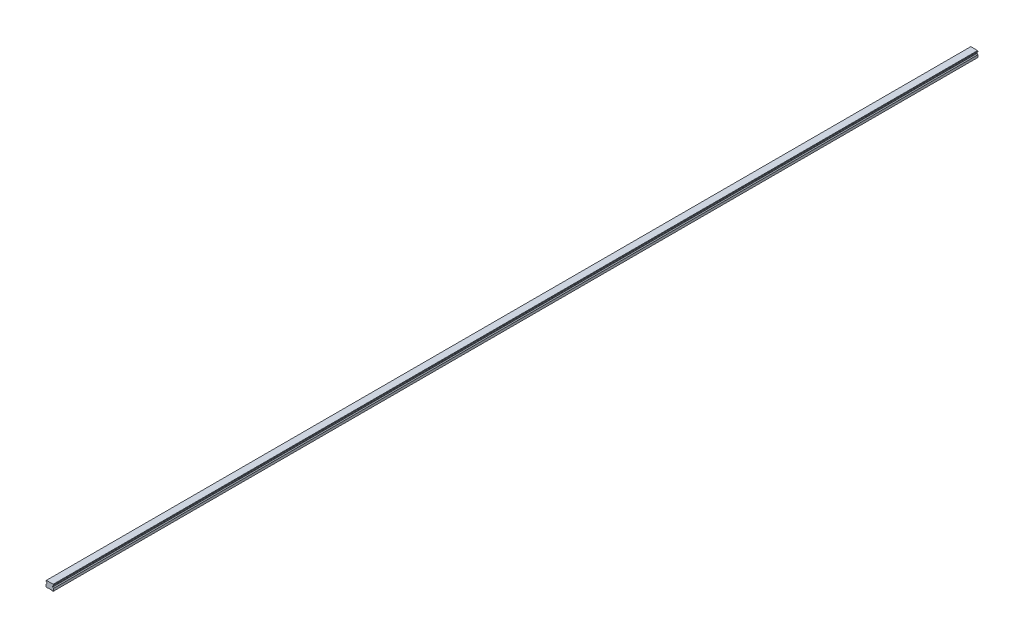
from build123d import *

# Parameters (mm, degrees)
SKETCH1_W           = 20
SKETCH1_H           = 16.3
BOSS_EXTRUDE1_DEPTH = 1220
CUT_EXTRUDE1_DEPTH  = 2441.074935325
CHAMFER1_SIZE       = 1
FILLET1_R           = 1
CUT_EXTRUDE2_DEPTH  = 2441.074935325
SKETCH5_R           = 3
SKETCH5_R_2         = 2.5
CUT_EXTRUDE5_DEPTH  = 10
SKETCH5_2_R         = 2.5
CUT_EXTRUDE6_DEPTH  = 13
LPATTERN2_COUNT     = 41
LPATTERN2_PITCH     = 60


with BuildPart() as part:
    # Sketch1 → Boss-Extrude1 (new, symmetric)
    with BuildSketch(Plane.XY):
        with Locations((0, 8.15)):
            Rectangle(SKETCH1_W, SKETCH1_H)
    extrude(amount=BOSS_EXTRUDE1_DEPTH, both=True)

    # Sketch2 → Cut-Extrude1 (cut, through all)
    with BuildSketch(Plane.XY.offset(1220)):
        Polygon((-10, 14.3), (-10, 7.3), (-7.666666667, 9.633333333), (-7.666666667, 11.966666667), align=None)
        Polygon((7.666666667, 11.966666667), (10, 14.3), (10, 7.3), (7.666666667, 9.633333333), align=None)
    extrude(amount=-CUT_EXTRUDE1_DEPTH, mode=Mode.SUBTRACT)

    # Chamfer1
    chamfer1_edges = [part.edges().sort_by_distance(p)[0] for p in [
        (-10, 16.3, 0),
        (10, 16.3, 0),
        (10, 0, 0),
        (-10, 0, 0),
    ]]
    chamfer(chamfer1_edges, length=CHAMFER1_SIZE)

    # Fillet1
    fillet1_edges = [part.edges().sort_by_distance(p)[0] for p in [
        (-7.666666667, 11.966666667, 0),
        (-7.666666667, 9.633333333, 0),
        (7.666666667, 9.633333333, 0),
        (7.666666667, 11.966666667, 0),
    ]]
    fillet(fillet1_edges, radius=FILLET1_R)

    # Sketch3 → Cut-Extrude2 (cut, through all)
    with BuildSketch(Plane.XY.offset(1220)):
        Polygon((-6, 0), (-5, 1), (5, 1), (6, 0), align=None)
    extrude(amount=-CUT_EXTRUDE2_DEPTH, mode=Mode.SUBTRACT)

    # Sketch5 → Cut-Extrude5 (cut)
    with BuildSketch(Plane.XZ.offset(-1)):
        with Locations(Location((0, 1200, 0), (0, 0, 270))):
            Circle(SKETCH5_R)
        with Locations(Location((0, 1200, 0), (0, 0, 270))):
            Circle(SKETCH5_R_2, mode=Mode.SUBTRACT)
    cut_extrude5 = extrude(amount=-CUT_EXTRUDE5_DEPTH, mode=Mode.SUBTRACT)

    # Sketch5_2 → Cut-Extrude6 (cut)
    with BuildSketch(Plane.XZ.offset(-1)):
        with Locations(Location((0, 1200, 0), (0, 0, 270))):
            Circle(SKETCH5_2_R)
    cut_extrude6 = extrude(amount=-CUT_EXTRUDE6_DEPTH, mode=Mode.SUBTRACT)

    # Cut-Extrude7 cone 1 section (on through the dimple's axis) → Cut-Extrude7 (revolve, cut)
    with BuildSketch(Plane(origin=(0, 14, 1200), x_dir=(0, 0, -1), z_dir=(1, 0, 0))):
        Polygon((0, 0), (2.5, 0), (0, 1.443375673), align=None)
    cut_extrude7 = revolve(axis=Axis((0, 14, 1200), (0, 1, 0)), mode=Mode.SUBTRACT)

    # LPattern2: Cut-Extrude5, Cut-Extrude6, Cut-Extrude7 ×41
    with Locations(*[(0, 0, -i * LPATTERN2_PITCH) for i in range(1, LPATTERN2_COUNT)]):
        add(cut_extrude5, mode=Mode.SUBTRACT)
        add(cut_extrude6, mode=Mode.SUBTRACT)
        add(cut_extrude7, mode=Mode.SUBTRACT)


solid = part.part
